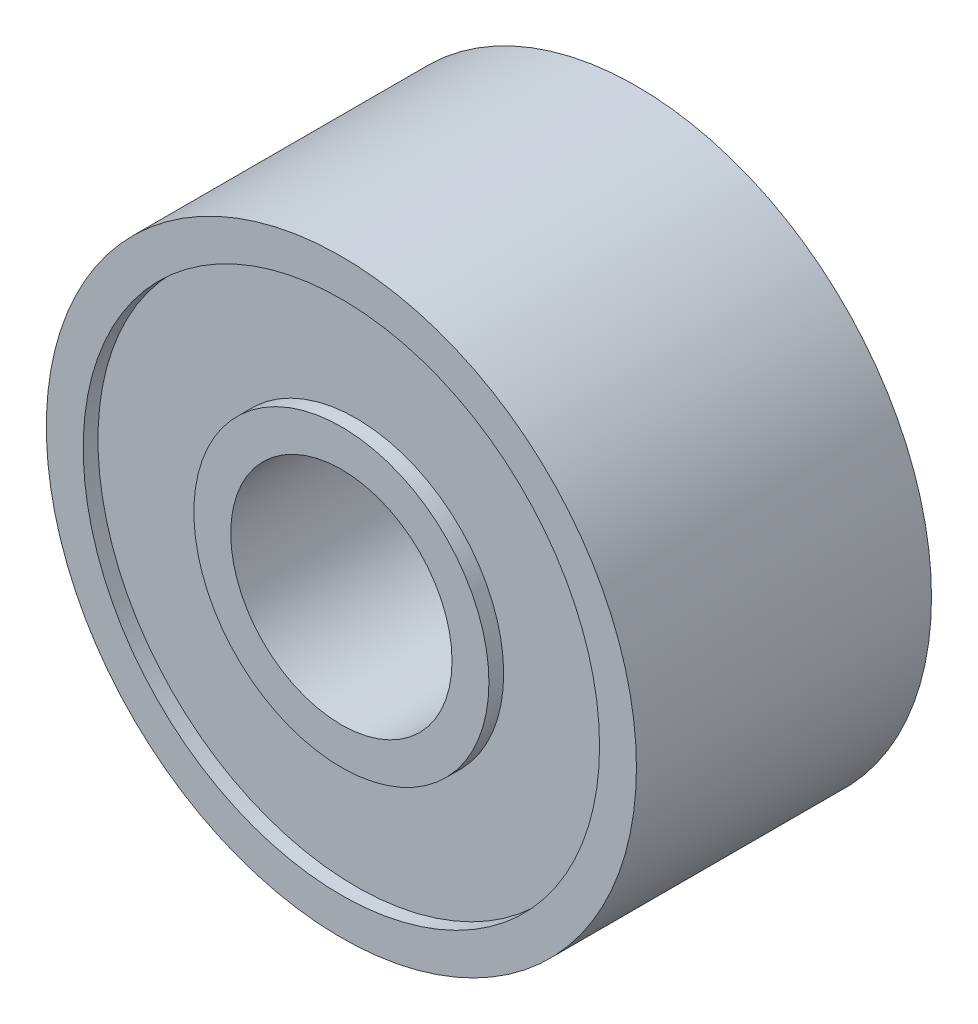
ISO-10303-21;
HEADER;
FILE_DESCRIPTION(('STEP AP214'),'2;1');
FILE_NAME('part.step','',(''),(''),'','','');
FILE_SCHEMA(('AUTOMOTIVE_DESIGN { 1 0 10303 214 1 1 1 1 }'));
ENDSEC;
DATA;
#1=APPLICATION_CONTEXT('core data for automotive mechanical design processes');
#2=APPLICATION_PROTOCOL_DEFINITION('international standard','automotive_design',2000,#1);
#3=PRODUCT_CONTEXT('',#1,'mechanical');
#4=PRODUCT('Part','Part','',(#3));
#5=PRODUCT_RELATED_PRODUCT_CATEGORY('part','',(#4));
#6=PRODUCT_DEFINITION_FORMATION('','',#4);
#7=PRODUCT_DEFINITION_CONTEXT('part definition',#1,'design');
#8=PRODUCT_DEFINITION('design','',#6,#7);
#9=PRODUCT_DEFINITION_SHAPE('','',#8);
#10=(LENGTH_UNIT() NAMED_UNIT(*) SI_UNIT(.MILLI.,.METRE.));
#11=(NAMED_UNIT(*) PLANE_ANGLE_UNIT() SI_UNIT($,.RADIAN.));
#12=(NAMED_UNIT(*) SI_UNIT($,.STERADIAN.) SOLID_ANGLE_UNIT());
#13=UNCERTAINTY_MEASURE_WITH_UNIT(LENGTH_MEASURE(1.E-05),#10,'distance_accuracy_value','');
#14=(GEOMETRIC_REPRESENTATION_CONTEXT(3) GLOBAL_UNCERTAINTY_ASSIGNED_CONTEXT((#13)) GLOBAL_UNIT_ASSIGNED_CONTEXT((#10,
#11,#12)) REPRESENTATION_CONTEXT('',''));
#15=CARTESIAN_POINT('',(0.,0.,0.));
#16=DIRECTION('',(0.,0.,1.));
#17=DIRECTION('',(1.,0.,0.));
#18=AXIS2_PLACEMENT_3D('',#15,#16,#17);
#19=CARTESIAN_POINT('',(0.,0.,0.));
#20=DIRECTION('',(0.,0.,1.));
#21=DIRECTION('',(1.,0.,0.));
#22=AXIS2_PLACEMENT_3D('',#19,#20,#21);
#23=PLANE('',#22);
#24=CARTESIAN_POINT('',(0.,0.,0.));
#25=DIRECTION('',(0.,0.,1.));
#26=DIRECTION('',(1.,0.,0.));
#27=AXIS2_PLACEMENT_3D('',#24,#25,#26);
#28=CIRCLE('',#27,1.5);
#29=CARTESIAN_POINT('',(1.5,0.,0.));
#30=VERTEX_POINT('',#29);
#31=EDGE_CURVE('E48',#30,#30,#28,.T.);
#32=ORIENTED_EDGE('',*,*,#31,.T.);
#33=EDGE_LOOP('',(#32));
#34=FACE_BOUND('',#33,.T.);
#35=CARTESIAN_POINT('',(0.,0.,0.));
#36=DIRECTION('',(0.,0.,-1.));
#37=DIRECTION('',(-1.,0.,0.));
#38=AXIS2_PLACEMENT_3D('',#35,#36,#37);
#39=CIRCLE('',#38,2.);
#40=CARTESIAN_POINT('',(-2.,0.,0.));
#41=VERTEX_POINT('',#40);
#42=EDGE_CURVE('E72',#41,#41,#39,.T.);
#43=ORIENTED_EDGE('',*,*,#42,.T.);
#44=EDGE_LOOP('',(#43));
#45=FACE_BOUND('',#44,.T.);
#46=ADVANCED_FACE('F35',(#34,#45),#23,.F.);
#47=CARTESIAN_POINT('',(0.,0.,4.));
#48=DIRECTION('',(0.,0.,1.));
#49=DIRECTION('',(1.,0.,0.));
#50=AXIS2_PLACEMENT_3D('',#47,#48,#49);
#51=PLANE('',#50);
#52=CARTESIAN_POINT('',(0.,0.,4.));
#53=DIRECTION('',(0.,0.,1.));
#54=DIRECTION('',(1.,0.,0.));
#55=AXIS2_PLACEMENT_3D('',#52,#53,#54);
#56=CIRCLE('',#55,1.5);
#57=CARTESIAN_POINT('',(1.5,0.,4.));
#58=VERTEX_POINT('',#57);
#59=EDGE_CURVE('E46',#58,#58,#56,.T.);
#60=ORIENTED_EDGE('',*,*,#59,.F.);
#61=EDGE_LOOP('',(#60));
#62=FACE_BOUND('',#61,.T.);
#63=CARTESIAN_POINT('',(0.,0.,4.));
#64=DIRECTION('',(0.,0.,1.));
#65=DIRECTION('',(1.,0.,0.));
#66=AXIS2_PLACEMENT_3D('',#63,#64,#65);
#67=CIRCLE('',#66,2.);
#68=CARTESIAN_POINT('',(2.,0.,4.));
#69=VERTEX_POINT('',#68);
#70=EDGE_CURVE('E60',#69,#69,#67,.T.);
#71=ORIENTED_EDGE('',*,*,#70,.T.);
#72=EDGE_LOOP('',(#71));
#73=FACE_BOUND('',#72,.T.);
#74=ADVANCED_FACE('F110',(#62,#73),#51,.T.);
#75=CARTESIAN_POINT('',(0.,0.,4.));
#76=DIRECTION('',(0.,0.,1.));
#77=DIRECTION('',(1.,0.,0.));
#78=AXIS2_PLACEMENT_3D('',#75,#76,#77);
#79=CIRCLE('',#78,3.5);
#80=CARTESIAN_POINT('',(3.5,0.,4.));
#81=VERTEX_POINT('',#80);
#82=EDGE_CURVE('E54',#81,#81,#79,.T.);
#83=ORIENTED_EDGE('',*,*,#82,.F.);
#84=EDGE_LOOP('',(#83));
#85=FACE_BOUND('',#84,.T.);
#86=CARTESIAN_POINT('',(0.,0.,4.));
#87=DIRECTION('',(0.,0.,1.));
#88=DIRECTION('',(1.,0.,0.));
#89=AXIS2_PLACEMENT_3D('',#86,#87,#88);
#90=CIRCLE('',#89,4.);
#91=CARTESIAN_POINT('',(4.,0.,4.));
#92=VERTEX_POINT('',#91);
#93=EDGE_CURVE('E10',#92,#92,#90,.T.);
#94=ORIENTED_EDGE('',*,*,#93,.T.);
#95=EDGE_LOOP('',(#94));
#96=FACE_BOUND('',#95,.T.);
#97=ADVANCED_FACE('F97',(#85,#96),#51,.T.);
#98=CARTESIAN_POINT('',(0.,0.,0.));
#99=DIRECTION('',(0.,0.,-1.));
#100=DIRECTION('',(-1.,0.,0.));
#101=AXIS2_PLACEMENT_3D('',#98,#99,#100);
#102=CIRCLE('',#101,3.5);
#103=CARTESIAN_POINT('',(-3.5,0.,0.));
#104=VERTEX_POINT('',#103);
#105=EDGE_CURVE('E66',#104,#104,#102,.T.);
#106=ORIENTED_EDGE('',*,*,#105,.F.);
#107=EDGE_LOOP('',(#106));
#108=FACE_BOUND('',#107,.T.);
#109=CARTESIAN_POINT('',(0.,0.,0.));
#110=DIRECTION('',(0.,0.,1.));
#111=DIRECTION('',(1.,0.,0.));
#112=AXIS2_PLACEMENT_3D('',#109,#110,#111);
#113=CIRCLE('',#112,4.);
#114=CARTESIAN_POINT('',(4.,0.,0.));
#115=VERTEX_POINT('',#114);
#116=EDGE_CURVE('E39',#115,#115,#113,.T.);
#117=ORIENTED_EDGE('',*,*,#116,.F.);
#118=EDGE_LOOP('',(#117));
#119=FACE_BOUND('',#118,.T.);
#120=ADVANCED_FACE('F94',(#108,#119),#23,.F.);
#121=CARTESIAN_POINT('',(0.,0.,4.));
#122=DIRECTION('',(0.,0.,-1.));
#123=DIRECTION('',(-1.,0.,0.));
#124=AXIS2_PLACEMENT_3D('',#121,#122,#123);
#125=CYLINDRICAL_SURFACE('',#124,4.);
#126=ORIENTED_EDGE('',*,*,#93,.F.);
#127=EDGE_LOOP('',(#126));
#128=FACE_BOUND('',#127,.T.);
#129=ORIENTED_EDGE('',*,*,#116,.T.);
#130=EDGE_LOOP('',(#129));
#131=FACE_BOUND('',#130,.T.);
#132=ADVANCED_FACE('F37',(#128,#131),#125,.T.);
#133=CARTESIAN_POINT('',(0.,0.,4.));
#134=DIRECTION('',(0.,0.,-1.));
#135=DIRECTION('',(-1.,0.,0.));
#136=AXIS2_PLACEMENT_3D('',#133,#134,#135);
#137=CYLINDRICAL_SURFACE('',#136,1.5);
#138=ORIENTED_EDGE('',*,*,#59,.T.);
#139=EDGE_LOOP('',(#138));
#140=FACE_BOUND('',#139,.T.);
#141=ORIENTED_EDGE('',*,*,#31,.F.);
#142=EDGE_LOOP('',(#141));
#143=FACE_BOUND('',#142,.T.);
#144=ADVANCED_FACE('F101',(#140,#143),#137,.F.);
#145=CARTESIAN_POINT('',(0.,0.,3.8));
#146=DIRECTION('',(0.,0.,1.));
#147=DIRECTION('',(1.,0.,0.));
#148=AXIS2_PLACEMENT_3D('',#145,#146,#147);
#149=CYLINDRICAL_SURFACE('',#148,3.5);
#150=CARTESIAN_POINT('',(0.,0.,3.8));
#151=DIRECTION('',(0.,0.,1.));
#152=DIRECTION('',(1.,0.,0.));
#153=AXIS2_PLACEMENT_3D('',#150,#151,#152);
#154=CIRCLE('',#153,3.5);
#155=CARTESIAN_POINT('',(3.5,0.,3.8));
#156=VERTEX_POINT('',#155);
#157=EDGE_CURVE('E51',#156,#156,#154,.T.);
#158=ORIENTED_EDGE('',*,*,#157,.F.);
#159=EDGE_LOOP('',(#158));
#160=FACE_BOUND('',#159,.T.);
#161=ORIENTED_EDGE('',*,*,#82,.T.);
#162=EDGE_LOOP('',(#161));
#163=FACE_BOUND('',#162,.T.);
#164=ADVANCED_FACE('F106',(#160,#163),#149,.F.);
#165=CARTESIAN_POINT('',(0.,0.,3.8));
#166=DIRECTION('',(0.,0.,1.));
#167=DIRECTION('',(1.,0.,0.));
#168=AXIS2_PLACEMENT_3D('',#165,#166,#167);
#169=PLANE('',#168);
#170=CARTESIAN_POINT('',(0.,0.,3.8));
#171=DIRECTION('',(0.,0.,1.));
#172=DIRECTION('',(1.,0.,0.));
#173=AXIS2_PLACEMENT_3D('',#170,#171,#172);
#174=CIRCLE('',#173,2.);
#175=CARTESIAN_POINT('',(2.,0.,3.8));
#176=VERTEX_POINT('',#175);
#177=EDGE_CURVE('E57',#176,#176,#174,.T.);
#178=ORIENTED_EDGE('',*,*,#177,.F.);
#179=EDGE_LOOP('',(#178));
#180=FACE_BOUND('',#179,.T.);
#181=ORIENTED_EDGE('',*,*,#157,.T.);
#182=EDGE_LOOP('',(#181));
#183=FACE_BOUND('',#182,.T.);
#184=ADVANCED_FACE('F123',(#180,#183),#169,.T.);
#185=CARTESIAN_POINT('',(0.,0.,3.8));
#186=DIRECTION('',(0.,0.,1.));
#187=DIRECTION('',(1.,0.,0.));
#188=AXIS2_PLACEMENT_3D('',#185,#186,#187);
#189=CYLINDRICAL_SURFACE('',#188,2.);
#190=ORIENTED_EDGE('',*,*,#177,.T.);
#191=EDGE_LOOP('',(#190));
#192=FACE_BOUND('',#191,.T.);
#193=ORIENTED_EDGE('',*,*,#70,.F.);
#194=EDGE_LOOP('',(#193));
#195=FACE_BOUND('',#194,.T.);
#196=ADVANCED_FACE('F90',(#192,#195),#189,.T.);
#197=CARTESIAN_POINT('',(0.,0.,0.2));
#198=DIRECTION('',(0.,0.,-1.));
#199=DIRECTION('',(-1.,0.,0.));
#200=AXIS2_PLACEMENT_3D('',#197,#198,#199);
#201=CYLINDRICAL_SURFACE('',#200,3.5);
#202=CARTESIAN_POINT('',(0.,0.,0.2));
#203=DIRECTION('',(0.,0.,-1.));
#204=DIRECTION('',(-1.,0.,0.));
#205=AXIS2_PLACEMENT_3D('',#202,#203,#204);
#206=CIRCLE('',#205,3.5);
#207=CARTESIAN_POINT('',(-3.5,0.,0.2));
#208=VERTEX_POINT('',#207);
#209=EDGE_CURVE('E63',#208,#208,#206,.T.);
#210=ORIENTED_EDGE('',*,*,#209,.F.);
#211=EDGE_LOOP('',(#210));
#212=FACE_BOUND('',#211,.T.);
#213=ORIENTED_EDGE('',*,*,#105,.T.);
#214=EDGE_LOOP('',(#213));
#215=FACE_BOUND('',#214,.T.);
#216=ADVANCED_FACE('F84',(#212,#215),#201,.F.);
#217=CARTESIAN_POINT('',(0.,0.,0.2));
#218=DIRECTION('',(0.,0.,-1.));
#219=DIRECTION('',(-1.,0.,0.));
#220=AXIS2_PLACEMENT_3D('',#217,#218,#219);
#221=PLANE('',#220);
#222=CARTESIAN_POINT('',(0.,0.,0.2));
#223=DIRECTION('',(0.,0.,-1.));
#224=DIRECTION('',(-1.,0.,0.));
#225=AXIS2_PLACEMENT_3D('',#222,#223,#224);
#226=CIRCLE('',#225,2.);
#227=CARTESIAN_POINT('',(-2.,0.,0.2));
#228=VERTEX_POINT('',#227);
#229=EDGE_CURVE('E69',#228,#228,#226,.T.);
#230=ORIENTED_EDGE('',*,*,#229,.F.);
#231=EDGE_LOOP('',(#230));
#232=FACE_BOUND('',#231,.T.);
#233=ORIENTED_EDGE('',*,*,#209,.T.);
#234=EDGE_LOOP('',(#233));
#235=FACE_BOUND('',#234,.T.);
#236=ADVANCED_FACE('F81',(#232,#235),#221,.T.);
#237=CARTESIAN_POINT('',(0.,0.,0.2));
#238=DIRECTION('',(0.,0.,-1.));
#239=DIRECTION('',(-1.,0.,0.));
#240=AXIS2_PLACEMENT_3D('',#237,#238,#239);
#241=CYLINDRICAL_SURFACE('',#240,2.);
#242=ORIENTED_EDGE('',*,*,#229,.T.);
#243=EDGE_LOOP('',(#242));
#244=FACE_BOUND('',#243,.T.);
#245=ORIENTED_EDGE('',*,*,#42,.F.);
#246=EDGE_LOOP('',(#245));
#247=FACE_BOUND('',#246,.T.);
#248=ADVANCED_FACE('F78',(#244,#247),#241,.T.);
#249=CLOSED_SHELL('',(#46,#74,#97,#120,#132,#144,#164,#184,#196,#216,#236,#248));
#250=MANIFOLD_SOLID_BREP('B2',#249);
#251=ADVANCED_BREP_SHAPE_REPRESENTATION('',(#18,#250),#14);
#252=SHAPE_DEFINITION_REPRESENTATION(#9,#251);
ENDSEC;
END-ISO-10303-21;
